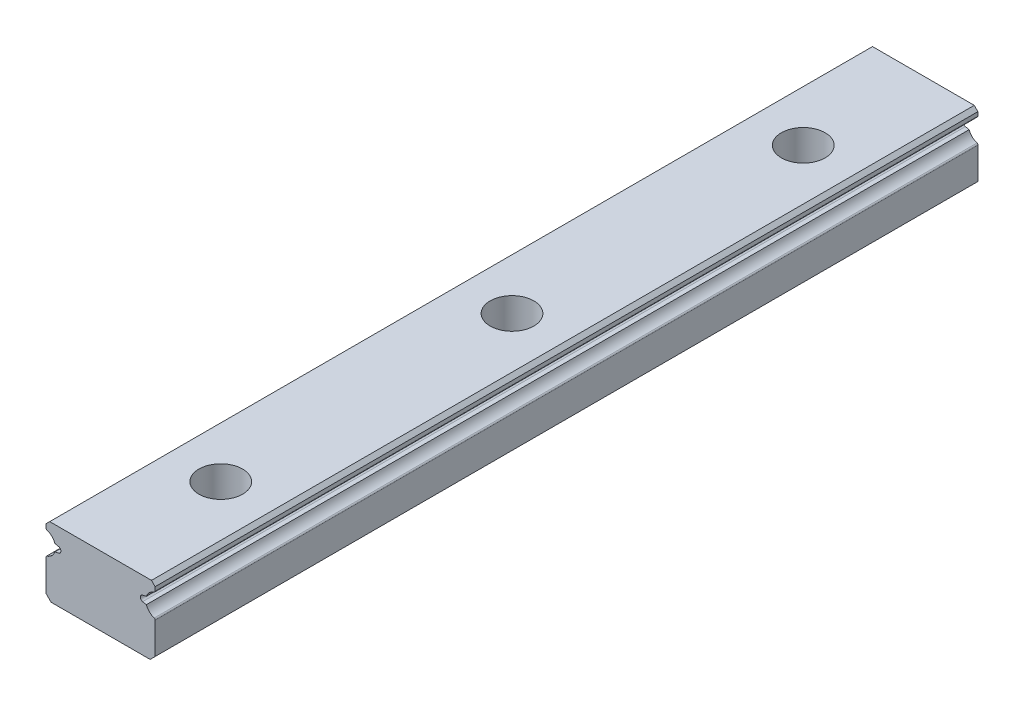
ISO-10303-21;
HEADER;
FILE_DESCRIPTION(('STEP AP214'),'2;1');
FILE_NAME('part.step','',(''),(''),'','','');
FILE_SCHEMA(('AUTOMOTIVE_DESIGN { 1 0 10303 214 1 1 1 1 }'));
ENDSEC;
DATA;
#1=APPLICATION_CONTEXT('core data for automotive mechanical design processes');
#2=APPLICATION_PROTOCOL_DEFINITION('international standard','automotive_design',2000,#1);
#3=PRODUCT_CONTEXT('',#1,'mechanical');
#4=PRODUCT('Part','Part','',(#3));
#5=PRODUCT_RELATED_PRODUCT_CATEGORY('part','',(#4));
#6=PRODUCT_DEFINITION_FORMATION('','',#4);
#7=PRODUCT_DEFINITION_CONTEXT('part definition',#1,'design');
#8=PRODUCT_DEFINITION('design','',#6,#7);
#9=PRODUCT_DEFINITION_SHAPE('','',#8);
#10=(LENGTH_UNIT() NAMED_UNIT(*) SI_UNIT(.MILLI.,.METRE.));
#11=(NAMED_UNIT(*) PLANE_ANGLE_UNIT() SI_UNIT($,.RADIAN.));
#12=(NAMED_UNIT(*) SI_UNIT($,.STERADIAN.) SOLID_ANGLE_UNIT());
#13=UNCERTAINTY_MEASURE_WITH_UNIT(LENGTH_MEASURE(1.E-05),#10,'distance_accuracy_value','');
#14=(GEOMETRIC_REPRESENTATION_CONTEXT(3) GLOBAL_UNCERTAINTY_ASSIGNED_CONTEXT((#13)) GLOBAL_UNIT_ASSIGNED_CONTEXT((#10,
#11,#12)) REPRESENTATION_CONTEXT('',''));
#15=CARTESIAN_POINT('',(0.,0.,0.));
#16=DIRECTION('',(0.,0.,1.));
#17=DIRECTION('',(1.,0.,0.));
#18=AXIS2_PLACEMENT_3D('',#15,#16,#17);
#19=CARTESIAN_POINT('',(-6.27999999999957,-8.749,-113.));
#20=DIRECTION('',(-0.209659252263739,-0.977774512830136,0.));
#21=DIRECTION('',(0.977774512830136,-0.209659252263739,0.));
#22=AXIS2_PLACEMENT_3D('',#19,#20,#21);
#23=PLANE('',#22);
#24=DIRECTION('',(0.977774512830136,-0.209659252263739,0.));
#25=VECTOR('',#24,1.);
#26=CARTESIAN_POINT('',(-6.27999999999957,-8.749,-113.));
#27=LINE('',#26,#25);
#28=CARTESIAN_POINT('',(-6.27999999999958,-8.749,-113.));
#29=VERTEX_POINT('',#28);
#30=CARTESIAN_POINT('',(-5.76751090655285,-8.85889044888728,-113.));
#31=VERTEX_POINT('',#30);
#32=EDGE_CURVE('E211',#29,#31,#27,.T.);
#33=ORIENTED_EDGE('',*,*,#32,.T.);
#34=DIRECTION('',(0.,0.,-1.));
#35=VECTOR('',#34,1.);
#36=CARTESIAN_POINT('',(-5.76751053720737,-8.85889052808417,-113.));
#37=LINE('',#36,#35);
#38=CARTESIAN_POINT('',(-5.76751090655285,-8.85889044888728,0.));
#39=VERTEX_POINT('',#38);
#40=EDGE_CURVE('E182',#31,#39,#37,.F.);
#41=ORIENTED_EDGE('',*,*,#40,.T.);
#42=DIRECTION('',(0.977774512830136,-0.209659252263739,0.));
#43=VECTOR('',#42,1.);
#44=CARTESIAN_POINT('',(-6.27999999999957,-8.749,0.));
#45=LINE('',#44,#43);
#46=CARTESIAN_POINT('',(-6.27999999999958,-8.749,0.));
#47=VERTEX_POINT('',#46);
#48=EDGE_CURVE('E219',#39,#47,#45,.F.);
#49=ORIENTED_EDGE('',*,*,#48,.T.);
#50=DIRECTION('',(0.,0.,-1.));
#51=VECTOR('',#50,1.);
#52=CARTESIAN_POINT('',(-6.27999999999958,-8.749,-113.));
#53=LINE('',#52,#51);
#54=EDGE_CURVE('E214',#47,#29,#53,.T.);
#55=ORIENTED_EDGE('',*,*,#54,.T.);
#56=EDGE_LOOP('',(#33,#41,#49,#55));
#57=FACE_BOUND('',#56,.T.);
#58=ADVANCED_FACE('F16',(#57),#23,.T.);
#59=CARTESIAN_POINT('',(5.7675105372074,-8.85889052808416,-113.));
#60=DIRECTION('',(0.20965925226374,-0.977774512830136,0.));
#61=DIRECTION('',(0.977774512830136,0.20965925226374,0.));
#62=AXIS2_PLACEMENT_3D('',#59,#60,#61);
#63=PLANE('',#62);
#64=DIRECTION('',(0.977774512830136,0.20965925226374,0.));
#65=VECTOR('',#64,1.);
#66=CARTESIAN_POINT('',(5.7675105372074,-8.85889052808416,-113.));
#67=LINE('',#66,#65);
#68=CARTESIAN_POINT('',(5.76751090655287,-8.85889044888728,-113.));
#69=VERTEX_POINT('',#68);
#70=CARTESIAN_POINT('',(6.27999999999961,-8.749,-113.));
#71=VERTEX_POINT('',#70);
#72=EDGE_CURVE('E184',#69,#71,#67,.T.);
#73=ORIENTED_EDGE('',*,*,#72,.T.);
#74=DIRECTION('',(0.,0.,-1.));
#75=VECTOR('',#74,1.);
#76=CARTESIAN_POINT('',(6.27999999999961,-8.749,-113.));
#77=LINE('',#76,#75);
#78=CARTESIAN_POINT('',(6.27999999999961,-8.749,0.));
#79=VERTEX_POINT('',#78);
#80=EDGE_CURVE('E222',#71,#79,#77,.F.);
#81=ORIENTED_EDGE('',*,*,#80,.T.);
#82=DIRECTION('',(0.977774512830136,0.20965925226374,0.));
#83=VECTOR('',#82,1.);
#84=CARTESIAN_POINT('',(5.7675105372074,-8.85889052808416,0.));
#85=LINE('',#84,#83);
#86=CARTESIAN_POINT('',(5.76751090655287,-8.85889044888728,0.));
#87=VERTEX_POINT('',#86);
#88=EDGE_CURVE('E209',#79,#87,#85,.F.);
#89=ORIENTED_EDGE('',*,*,#88,.T.);
#90=DIRECTION('',(0.,0.,-1.));
#91=VECTOR('',#90,1.);
#92=CARTESIAN_POINT('',(5.7675105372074,-8.85889052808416,-113.));
#93=LINE('',#92,#91);
#94=EDGE_CURVE('E204',#87,#69,#93,.T.);
#95=ORIENTED_EDGE('',*,*,#94,.T.);
#96=EDGE_LOOP('',(#73,#81,#89,#95));
#97=FACE_BOUND('',#96,.T.);
#98=ADVANCED_FACE('F792',(#97),#63,.T.);
#99=CARTESIAN_POINT('',(-5.85137497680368,-9.25000017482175,-113.));
#100=DIRECTION('',(0.,0.,-1.));
#101=DIRECTION('',(-1.,0.,0.));
#102=AXIS2_PLACEMENT_3D('',#99,#100,#101);
#103=CYLINDRICAL_SURFACE('',#102,0.4);
#104=ORIENTED_EDGE('',*,*,#40,.F.);
#105=CARTESIAN_POINT('',(-5.85137497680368,-9.25000017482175,-113.));
#106=DIRECTION('',(0.,0.,-1.));
#107=DIRECTION('',(-1.,0.,0.));
#108=AXIS2_PLACEMENT_3D('',#105,#106,#107);
#109=CIRCLE('',#108,0.4);
#110=CARTESIAN_POINT('',(-5.767,-9.641,-113.));
#111=VERTEX_POINT('',#110);
#112=EDGE_CURVE('E19',#111,#31,#109,.F.);
#113=ORIENTED_EDGE('',*,*,#112,.F.);
#114=DIRECTION('',(0.,0.,1.));
#115=VECTOR('',#114,1.);
#116=CARTESIAN_POINT('',(-5.767,-9.641,-113.));
#117=LINE('',#116,#115);
#118=CARTESIAN_POINT('',(-5.767,-9.641,0.));
#119=VERTEX_POINT('',#118);
#120=EDGE_CURVE('E179',#119,#111,#117,.F.);
#121=ORIENTED_EDGE('',*,*,#120,.F.);
#122=CARTESIAN_POINT('',(-5.85137497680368,-9.25000017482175,0.));
#123=DIRECTION('',(0.,0.,-1.));
#124=DIRECTION('',(-1.,0.,0.));
#125=AXIS2_PLACEMENT_3D('',#122,#123,#124);
#126=CIRCLE('',#125,0.4);
#127=EDGE_CURVE('E226',#39,#119,#126,.T.);
#128=ORIENTED_EDGE('',*,*,#127,.F.);
#129=EDGE_LOOP('',(#104,#113,#121,#128));
#130=FACE_BOUND('',#129,.T.);
#131=ADVANCED_FACE('F176',(#130),#103,.F.);
#132=CARTESIAN_POINT('',(7.89004225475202,-9.33975285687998,-113.));
#133=DIRECTION('',(0.,0.,-1.));
#134=DIRECTION('',(-1.,0.,0.));
#135=AXIS2_PLACEMENT_3D('',#132,#133,#134);
#136=CYLINDRICAL_SURFACE('',#135,1.715);
#137=ORIENTED_EDGE('',*,*,#80,.F.);
#138=CARTESIAN_POINT('',(7.89004225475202,-9.33975285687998,-113.));
#139=DIRECTION('',(0.,0.,-1.));
#140=DIRECTION('',(-1.,0.,0.));
#141=AXIS2_PLACEMENT_3D('',#138,#139,#140);
#142=CIRCLE('',#141,1.715);
#143=CARTESIAN_POINT('',(7.35000000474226,-7.71199999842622,-113.));
#144=VERTEX_POINT('',#143);
#145=EDGE_CURVE('E225',#144,#71,#142,.F.);
#146=ORIENTED_EDGE('',*,*,#145,.F.);
#147=DIRECTION('',(0.,0.,-1.));
#148=VECTOR('',#147,1.);
#149=CARTESIAN_POINT('',(7.35000000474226,-7.71199999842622,-113.));
#150=LINE('',#149,#148);
#151=CARTESIAN_POINT('',(7.35000000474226,-7.71199999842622,0.));
#152=VERTEX_POINT('',#151);
#153=EDGE_CURVE('E202',#152,#144,#150,.T.);
#154=ORIENTED_EDGE('',*,*,#153,.F.);
#155=CARTESIAN_POINT('',(7.89004225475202,-9.33975285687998,0.));
#156=DIRECTION('',(0.,0.,-1.));
#157=DIRECTION('',(-1.,0.,0.));
#158=AXIS2_PLACEMENT_3D('',#155,#156,#157);
#159=CIRCLE('',#158,1.715);
#160=EDGE_CURVE('E218',#79,#152,#159,.T.);
#161=ORIENTED_EDGE('',*,*,#160,.F.);
#162=EDGE_LOOP('',(#137,#146,#154,#161));
#163=FACE_BOUND('',#162,.T.);
#164=ADVANCED_FACE('F776',(#163),#136,.F.);
#165=CARTESIAN_POINT('',(-7.890042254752,-9.33975285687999,-113.));
#166=DIRECTION('',(0.,0.,-1.));
#167=DIRECTION('',(-1.,0.,0.));
#168=AXIS2_PLACEMENT_3D('',#165,#166,#167);
#169=CYLINDRICAL_SURFACE('',#168,1.715);
#170=DIRECTION('',(0.,0.,-1.));
#171=VECTOR('',#170,1.);
#172=CARTESIAN_POINT('',(-7.34999999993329,-7.7120000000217,-113.));
#173=LINE('',#172,#171);
#174=CARTESIAN_POINT('',(-7.34999999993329,-7.71200000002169,-113.));
#175=VERTEX_POINT('',#174);
#176=CARTESIAN_POINT('',(-7.34999999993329,-7.7120000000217,0.));
#177=VERTEX_POINT('',#176);
#178=EDGE_CURVE('E297',#175,#177,#173,.F.);
#179=ORIENTED_EDGE('',*,*,#178,.F.);
#180=CARTESIAN_POINT('',(-7.890042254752,-9.33975285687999,-113.));
#181=DIRECTION('',(0.,0.,-1.));
#182=DIRECTION('',(-1.,0.,0.));
#183=AXIS2_PLACEMENT_3D('',#180,#181,#182);
#184=CIRCLE('',#183,1.715);
#185=EDGE_CURVE('E217',#29,#175,#184,.F.);
#186=ORIENTED_EDGE('',*,*,#185,.F.);
#187=ORIENTED_EDGE('',*,*,#54,.F.);
#188=CARTESIAN_POINT('',(-7.890042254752,-9.33975285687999,0.));
#189=DIRECTION('',(0.,0.,-1.));
#190=DIRECTION('',(-1.,0.,0.));
#191=AXIS2_PLACEMENT_3D('',#188,#189,#190);
#192=CIRCLE('',#191,1.715);
#193=EDGE_CURVE('E208',#177,#47,#192,.T.);
#194=ORIENTED_EDGE('',*,*,#193,.F.);
#195=EDGE_LOOP('',(#179,#186,#187,#194));
#196=FACE_BOUND('',#195,.T.);
#197=ADVANCED_FACE('F322',(#196),#169,.F.);
#198=CARTESIAN_POINT('',(5.85137497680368,-9.25000017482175,-113.));
#199=DIRECTION('',(0.,0.,-1.));
#200=DIRECTION('',(-1.,0.,0.));
#201=AXIS2_PLACEMENT_3D('',#198,#199,#200);
#202=CYLINDRICAL_SURFACE('',#201,0.4);
#203=DIRECTION('',(0.,0.,1.));
#204=VECTOR('',#203,1.);
#205=CARTESIAN_POINT('',(5.767,-9.641,-113.));
#206=LINE('',#205,#204);
#207=CARTESIAN_POINT('',(5.767,-9.641,-113.));
#208=VERTEX_POINT('',#207);
#209=CARTESIAN_POINT('',(5.767,-9.641,0.));
#210=VERTEX_POINT('',#209);
#211=EDGE_CURVE('E293',#208,#210,#206,.T.);
#212=ORIENTED_EDGE('',*,*,#211,.F.);
#213=CARTESIAN_POINT('',(5.85137497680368,-9.25000017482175,-113.));
#214=DIRECTION('',(0.,0.,-1.));
#215=DIRECTION('',(-1.,0.,0.));
#216=AXIS2_PLACEMENT_3D('',#213,#214,#215);
#217=CIRCLE('',#216,0.4);
#218=EDGE_CURVE('E207',#69,#208,#217,.F.);
#219=ORIENTED_EDGE('',*,*,#218,.F.);
#220=ORIENTED_EDGE('',*,*,#94,.F.);
#221=CARTESIAN_POINT('',(5.85137497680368,-9.25000017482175,0.));
#222=DIRECTION('',(0.,0.,-1.));
#223=DIRECTION('',(-1.,0.,0.));
#224=AXIS2_PLACEMENT_3D('',#221,#222,#223);
#225=CIRCLE('',#224,0.4);
#226=EDGE_CURVE('E198',#210,#87,#225,.T.);
#227=ORIENTED_EDGE('',*,*,#226,.F.);
#228=EDGE_LOOP('',(#212,#219,#220,#227));
#229=FACE_BOUND('',#228,.T.);
#230=ADVANCED_FACE('F760',(#229),#202,.F.);
#231=CARTESIAN_POINT('',(-5.767,-9.641,-113.));
#232=DIRECTION('',(-0.207835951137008,0.978163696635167,0.));
#233=DIRECTION('',(-0.978163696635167,-0.207835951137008,0.));
#234=AXIS2_PLACEMENT_3D('',#231,#232,#233);
#235=PLANE('',#234);
#236=DIRECTION('',(-0.978163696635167,-0.207835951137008,0.));
#237=VECTOR('',#236,1.);
#238=CARTESIAN_POINT('',(-5.767,-9.641,-113.));
#239=LINE('',#238,#237);
#240=CARTESIAN_POINT('',(-6.28,-9.75,-113.));
#241=VERTEX_POINT('',#240);
#242=EDGE_CURVE('E186',#111,#241,#239,.T.);
#243=ORIENTED_EDGE('',*,*,#242,.T.);
#244=DIRECTION('',(0.,0.,-1.));
#245=VECTOR('',#244,1.);
#246=CARTESIAN_POINT('',(-6.28,-9.75,-113.));
#247=LINE('',#246,#245);
#248=CARTESIAN_POINT('',(-6.28,-9.75,0.));
#249=VERTEX_POINT('',#248);
#250=EDGE_CURVE('E291',#241,#249,#247,.F.);
#251=ORIENTED_EDGE('',*,*,#250,.T.);
#252=DIRECTION('',(-0.978163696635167,-0.207835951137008,0.));
#253=VECTOR('',#252,1.);
#254=CARTESIAN_POINT('',(-5.767,-9.641,0.));
#255=LINE('',#254,#253);
#256=EDGE_CURVE('E196',#249,#119,#255,.F.);
#257=ORIENTED_EDGE('',*,*,#256,.T.);
#258=ORIENTED_EDGE('',*,*,#120,.T.);
#259=EDGE_LOOP('',(#243,#251,#257,#258));
#260=FACE_BOUND('',#259,.T.);
#261=ADVANCED_FACE('F195',(#260),#235,.T.);
#262=CARTESIAN_POINT('',(7.287,-7.52218166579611,-113.));
#263=DIRECTION('',(0.,0.,-1.));
#264=DIRECTION('',(-1.,0.,0.));
#265=AXIS2_PLACEMENT_3D('',#262,#263,#264);
#266=CYLINDRICAL_SURFACE('',#265,0.2);
#267=CARTESIAN_POINT('',(7.287,-7.52218166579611,-113.));
#268=DIRECTION('',(0.,0.,-1.));
#269=DIRECTION('',(-1.,0.,0.));
#270=AXIS2_PLACEMENT_3D('',#267,#268,#269);
#271=CIRCLE('',#270,0.2);
#272=CARTESIAN_POINT('',(7.487,-7.52218165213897,-113.));
#273=VERTEX_POINT('',#272);
#274=EDGE_CURVE('E301',#144,#273,#271,.F.);
#275=ORIENTED_EDGE('',*,*,#274,.T.);
#276=DIRECTION('',(0.,0.,-1.));
#277=VECTOR('',#276,1.);
#278=CARTESIAN_POINT('',(7.487,-7.52218163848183,-113.));
#279=LINE('',#278,#277);
#280=CARTESIAN_POINT('',(7.487,-7.52218165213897,0.));
#281=VERTEX_POINT('',#280);
#282=EDGE_CURVE('E359',#281,#273,#279,.T.);
#283=ORIENTED_EDGE('',*,*,#282,.F.);
#284=CARTESIAN_POINT('',(7.287,-7.52218166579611,0.));
#285=DIRECTION('',(0.,0.,-1.));
#286=DIRECTION('',(-1.,0.,0.));
#287=AXIS2_PLACEMENT_3D('',#284,#285,#286);
#288=CIRCLE('',#287,0.2);
#289=EDGE_CURVE('E193',#281,#152,#288,.T.);
#290=ORIENTED_EDGE('',*,*,#289,.T.);
#291=ORIENTED_EDGE('',*,*,#153,.T.);
#292=EDGE_LOOP('',(#275,#283,#290,#291));
#293=FACE_BOUND('',#292,.T.);
#294=ADVANCED_FACE('F745',(#293),#266,.T.);
#295=CARTESIAN_POINT('',(-7.288,-7.52185268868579,-113.));
#296=DIRECTION('',(0.,0.,-1.));
#297=DIRECTION('',(-1.,0.,0.));
#298=AXIS2_PLACEMENT_3D('',#295,#296,#297);
#299=CYLINDRICAL_SURFACE('',#298,0.200000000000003);
#300=CARTESIAN_POINT('',(-7.288,-7.52185268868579,-113.));
#301=DIRECTION('',(0.,0.,-1.));
#302=DIRECTION('',(-1.,0.,0.));
#303=AXIS2_PLACEMENT_3D('',#300,#301,#302);
#304=CIRCLE('',#303,0.200000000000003);
#305=CARTESIAN_POINT('',(-7.488,-7.52185267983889,-113.));
#306=VERTEX_POINT('',#305);
#307=EDGE_CURVE('E294',#306,#175,#304,.F.);
#308=ORIENTED_EDGE('',*,*,#307,.T.);
#309=ORIENTED_EDGE('',*,*,#178,.T.);
#310=CARTESIAN_POINT('',(-7.288,-7.52185268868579,0.));
#311=DIRECTION('',(0.,0.,-1.));
#312=DIRECTION('',(-1.,0.,0.));
#313=AXIS2_PLACEMENT_3D('',#310,#311,#312);
#314=CIRCLE('',#313,0.200000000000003);
#315=CARTESIAN_POINT('',(-7.488,-7.52185267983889,0.));
#316=VERTEX_POINT('',#315);
#317=EDGE_CURVE('E298',#177,#316,#314,.T.);
#318=ORIENTED_EDGE('',*,*,#317,.T.);
#319=DIRECTION('',(0.,0.,1.));
#320=VECTOR('',#319,1.);
#321=CARTESIAN_POINT('',(-7.488,-7.52185267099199,-113.));
#322=LINE('',#321,#320);
#323=EDGE_CURVE('E327',#306,#316,#322,.T.);
#324=ORIENTED_EDGE('',*,*,#323,.F.);
#325=EDGE_LOOP('',(#308,#309,#318,#324));
#326=FACE_BOUND('',#325,.T.);
#327=ADVANCED_FACE('F325',(#326),#299,.T.);
#328=CARTESIAN_POINT('',(6.28,-9.75,-113.));
#329=DIRECTION('',(0.207835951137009,0.978163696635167,0.));
#330=DIRECTION('',(-0.978163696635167,0.207835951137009,0.));
#331=AXIS2_PLACEMENT_3D('',#328,#329,#330);
#332=PLANE('',#331);
#333=DIRECTION('',(-0.978163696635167,0.207835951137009,0.));
#334=VECTOR('',#333,1.);
#335=CARTESIAN_POINT('',(6.28,-9.75,-113.));
#336=LINE('',#335,#334);
#337=CARTESIAN_POINT('',(6.28,-9.75,-113.));
#338=VERTEX_POINT('',#337);
#339=EDGE_CURVE('E383',#338,#208,#336,.T.);
#340=ORIENTED_EDGE('',*,*,#339,.T.);
#341=ORIENTED_EDGE('',*,*,#211,.T.);
#342=DIRECTION('',(-0.978163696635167,0.207835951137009,0.));
#343=VECTOR('',#342,1.);
#344=CARTESIAN_POINT('',(6.28,-9.75,0.));
#345=LINE('',#344,#343);
#346=CARTESIAN_POINT('',(6.28,-9.75,0.));
#347=VERTEX_POINT('',#346);
#348=EDGE_CURVE('E324',#210,#347,#345,.F.);
#349=ORIENTED_EDGE('',*,*,#348,.T.);
#350=DIRECTION('',(0.,0.,-1.));
#351=VECTOR('',#350,1.);
#352=CARTESIAN_POINT('',(6.28,-9.75,-113.));
#353=LINE('',#352,#351);
#354=EDGE_CURVE('E287',#347,#338,#353,.T.);
#355=ORIENTED_EDGE('',*,*,#354,.T.);
#356=EDGE_LOOP('',(#340,#341,#349,#355));
#357=FACE_BOUND('',#356,.T.);
#358=ADVANCED_FACE('F490',(#357),#332,.T.);
#359=CARTESIAN_POINT('',(-7.89007044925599,-9.159323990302,-113.));
#360=DIRECTION('',(0.,0.,-1.));
#361=DIRECTION('',(-1.,0.,0.));
#362=AXIS2_PLACEMENT_3D('',#359,#360,#361);
#363=CYLINDRICAL_SURFACE('',#362,1.715);
#364=ORIENTED_EDGE('',*,*,#250,.F.);
#365=CARTESIAN_POINT('',(-7.89007044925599,-9.159323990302,-113.));
#366=DIRECTION('',(0.,0.,-1.));
#367=DIRECTION('',(-1.,0.,0.));
#368=AXIS2_PLACEMENT_3D('',#365,#366,#367);
#369=CIRCLE('',#368,1.715);
#370=CARTESIAN_POINT('',(-7.36199999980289,-10.7909999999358,-113.));
#371=VERTEX_POINT('',#370);
#372=EDGE_CURVE('E189',#371,#241,#369,.F.);
#373=ORIENTED_EDGE('',*,*,#372,.F.);
#374=DIRECTION('',(0.,0.,-1.));
#375=VECTOR('',#374,1.);
#376=CARTESIAN_POINT('',(-7.36199999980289,-10.7909999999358,-113.));
#377=LINE('',#376,#375);
#378=CARTESIAN_POINT('',(-7.36199999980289,-10.7909999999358,0.));
#379=VERTEX_POINT('',#378);
#380=EDGE_CURVE('E278',#379,#371,#377,.T.);
#381=ORIENTED_EDGE('',*,*,#380,.F.);
#382=CARTESIAN_POINT('',(-7.89007044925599,-9.159323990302,0.));
#383=DIRECTION('',(0.,0.,-1.));
#384=DIRECTION('',(-1.,0.,0.));
#385=AXIS2_PLACEMENT_3D('',#382,#383,#384);
#386=CIRCLE('',#385,1.715);
#387=EDGE_CURVE('E288',#249,#379,#386,.T.);
#388=ORIENTED_EDGE('',*,*,#387,.F.);
#389=EDGE_LOOP('',(#364,#373,#381,#388));
#390=FACE_BOUND('',#389,.T.);
#391=ADVANCED_FACE('F487',(#390),#363,.F.);
#392=CARTESIAN_POINT('',(7.487,-7.52218163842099,-113.));
#393=DIRECTION('',(1.,0.,0.));
#394=DIRECTION('',(0.,0.,-1.));
#395=AXIS2_PLACEMENT_3D('',#392,#393,#394);
#396=PLANE('',#395);
#397=DIRECTION('',(0.,1.,0.));
#398=VECTOR('',#397,1.);
#399=CARTESIAN_POINT('',(7.487,-7.52218163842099,-113.));
#400=LINE('',#399,#398);
#401=CARTESIAN_POINT('',(7.487,-7.,-113.));
#402=VERTEX_POINT('',#401);
#403=EDGE_CURVE('E339',#273,#402,#400,.T.);
#404=ORIENTED_EDGE('',*,*,#403,.T.);
#405=DIRECTION('',(0.,0.,1.));
#406=VECTOR('',#405,1.);
#407=CARTESIAN_POINT('',(7.487,-7.,-113.));
#408=LINE('',#407,#406);
#409=CARTESIAN_POINT('',(7.487,-7.,0.));
#410=VERTEX_POINT('',#409);
#411=EDGE_CURVE('E366',#410,#402,#408,.F.);
#412=ORIENTED_EDGE('',*,*,#411,.F.);
#413=DIRECTION('',(0.,1.,0.));
#414=VECTOR('',#413,1.);
#415=CARTESIAN_POINT('',(7.487,-7.52218163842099,0.));
#416=LINE('',#415,#414);
#417=EDGE_CURVE('E290',#410,#281,#416,.F.);
#418=ORIENTED_EDGE('',*,*,#417,.T.);
#419=ORIENTED_EDGE('',*,*,#282,.T.);
#420=EDGE_LOOP('',(#404,#412,#418,#419));
#421=FACE_BOUND('',#420,.T.);
#422=ADVANCED_FACE('F489',(#421),#396,.T.);
#423=CARTESIAN_POINT('',(-7.488,-7.,-113.));
#424=DIRECTION('',(-1.,0.,0.));
#425=DIRECTION('',(0.,0.,1.));
#426=AXIS2_PLACEMENT_3D('',#423,#424,#425);
#427=PLANE('',#426);
#428=DIRECTION('',(0.,1.,0.));
#429=VECTOR('',#428,1.);
#430=CARTESIAN_POINT('',(-7.488,-7.,-113.));
#431=LINE('',#430,#429);
#432=CARTESIAN_POINT('',(-7.488,-7.,-113.));
#433=VERTEX_POINT('',#432);
#434=EDGE_CURVE('E331',#433,#306,#431,.F.);
#435=ORIENTED_EDGE('',*,*,#434,.T.);
#436=ORIENTED_EDGE('',*,*,#323,.T.);
#437=DIRECTION('',(0.,1.,0.));
#438=VECTOR('',#437,1.);
#439=CARTESIAN_POINT('',(-7.488,-7.,0.));
#440=LINE('',#439,#438);
#441=CARTESIAN_POINT('',(-7.488,-7.,0.));
#442=VERTEX_POINT('',#441);
#443=EDGE_CURVE('E337',#316,#442,#440,.T.);
#444=ORIENTED_EDGE('',*,*,#443,.T.);
#445=DIRECTION('',(0.,0.,1.));
#446=VECTOR('',#445,1.);
#447=CARTESIAN_POINT('',(-7.488,-7.,-113.));
#448=LINE('',#447,#446);
#449=EDGE_CURVE('E274',#433,#442,#448,.T.);
#450=ORIENTED_EDGE('',*,*,#449,.F.);
#451=EDGE_LOOP('',(#435,#436,#444,#450));
#452=FACE_BOUND('',#451,.T.);
#453=ADVANCED_FACE('F334',(#452),#427,.T.);
#454=CARTESIAN_POINT('',(7.890070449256,-9.159323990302,-113.));
#455=DIRECTION('',(0.,0.,-1.));
#456=DIRECTION('',(-1.,0.,0.));
#457=AXIS2_PLACEMENT_3D('',#454,#455,#456);
#458=CYLINDRICAL_SURFACE('',#457,1.715);
#459=DIRECTION('',(0.,0.,-1.));
#460=VECTOR('',#459,1.);
#461=CARTESIAN_POINT('',(7.36199999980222,-10.7909999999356,-113.));
#462=LINE('',#461,#460);
#463=CARTESIAN_POINT('',(7.36199999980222,-10.7909999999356,-113.));
#464=VERTEX_POINT('',#463);
#465=CARTESIAN_POINT('',(7.36199999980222,-10.7909999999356,0.));
#466=VERTEX_POINT('',#465);
#467=EDGE_CURVE('E268',#464,#466,#462,.F.);
#468=ORIENTED_EDGE('',*,*,#467,.F.);
#469=CARTESIAN_POINT('',(7.890070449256,-9.159323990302,-113.));
#470=DIRECTION('',(0.,0.,-1.));
#471=DIRECTION('',(-1.,0.,0.));
#472=AXIS2_PLACEMENT_3D('',#469,#470,#471);
#473=CIRCLE('',#472,1.715);
#474=EDGE_CURVE('E285',#338,#464,#473,.F.);
#475=ORIENTED_EDGE('',*,*,#474,.F.);
#476=ORIENTED_EDGE('',*,*,#354,.F.);
#477=CARTESIAN_POINT('',(7.890070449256,-9.159323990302,0.));
#478=DIRECTION('',(0.,0.,-1.));
#479=DIRECTION('',(-1.,0.,0.));
#480=AXIS2_PLACEMENT_3D('',#477,#478,#479);
#481=CIRCLE('',#480,1.715);
#482=EDGE_CURVE('E282',#466,#347,#481,.T.);
#483=ORIENTED_EDGE('',*,*,#482,.F.);
#484=EDGE_LOOP('',(#468,#475,#476,#483));
#485=FACE_BOUND('',#484,.T.);
#486=ADVANCED_FACE('F577',(#485),#458,.F.);
#487=CARTESIAN_POINT('',(-7.3,-10.9811473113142,-113.));
#488=DIRECTION('',(0.,0.,-1.));
#489=DIRECTION('',(-1.,0.,0.));
#490=AXIS2_PLACEMENT_3D('',#487,#488,#489);
#491=CYLINDRICAL_SURFACE('',#490,0.200000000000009);
#492=CARTESIAN_POINT('',(-7.3,-10.9811473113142,-113.));
#493=DIRECTION('',(0.,0.,-1.));
#494=DIRECTION('',(-1.,0.,0.));
#495=AXIS2_PLACEMENT_3D('',#492,#493,#494);
#496=CIRCLE('',#495,0.200000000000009);
#497=CARTESIAN_POINT('',(-7.5,-10.9811473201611,-113.));
#498=VERTEX_POINT('',#497);
#499=EDGE_CURVE('E275',#371,#498,#496,.F.);
#500=ORIENTED_EDGE('',*,*,#499,.T.);
#501=DIRECTION('',(0.,0.,1.));
#502=VECTOR('',#501,1.);
#503=CARTESIAN_POINT('',(-7.5,-10.981147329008,-113.));
#504=LINE('',#503,#502);
#505=CARTESIAN_POINT('',(-7.5,-10.9811473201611,0.));
#506=VERTEX_POINT('',#505);
#507=EDGE_CURVE('E264',#506,#498,#504,.F.);
#508=ORIENTED_EDGE('',*,*,#507,.F.);
#509=CARTESIAN_POINT('',(-7.3,-10.9811473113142,0.));
#510=DIRECTION('',(0.,0.,-1.));
#511=DIRECTION('',(-1.,0.,0.));
#512=AXIS2_PLACEMENT_3D('',#509,#510,#511);
#513=CIRCLE('',#512,0.200000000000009);
#514=EDGE_CURVE('E279',#506,#379,#513,.T.);
#515=ORIENTED_EDGE('',*,*,#514,.T.);
#516=ORIENTED_EDGE('',*,*,#380,.T.);
#517=EDGE_LOOP('',(#500,#508,#515,#516));
#518=FACE_BOUND('',#517,.T.);
#519=ADVANCED_FACE('F483',(#518),#491,.T.);
#520=CARTESIAN_POINT('',(0.,-16.,-56.5));
#521=DIRECTION('',(0.,1.,0.));
#522=DIRECTION('',(0.,0.,1.));
#523=AXIS2_PLACEMENT_3D('',#520,#521,#522);
#524=CYLINDRICAL_SURFACE('',#523,3.);
#525=CARTESIAN_POINT('',(0.,-6.5,-56.5));
#526=DIRECTION('',(0.,1.,0.));
#527=DIRECTION('',(0.,0.,1.));
#528=AXIS2_PLACEMENT_3D('',#525,#526,#527);
#529=CIRCLE('',#528,3.);
#530=CARTESIAN_POINT('',(0.,-6.5,-53.5));
#531=VERTEX_POINT('',#530);
#532=EDGE_CURVE('E260',#531,#531,#529,.F.);
#533=ORIENTED_EDGE('',*,*,#532,.F.);
#534=EDGE_LOOP('',(#533));
#535=FACE_BOUND('',#534,.T.);
#536=CARTESIAN_POINT('',(0.,-11.,-56.5));
#537=DIRECTION('',(0.,1.,0.));
#538=DIRECTION('',(0.,0.,1.));
#539=AXIS2_PLACEMENT_3D('',#536,#537,#538);
#540=CIRCLE('',#539,3.);
#541=CARTESIAN_POINT('',(0.,-11.,-53.5));
#542=VERTEX_POINT('',#541);
#543=EDGE_CURVE('E265',#542,#542,#540,.T.);
#544=ORIENTED_EDGE('',*,*,#543,.F.);
#545=EDGE_LOOP('',(#544));
#546=FACE_BOUND('',#545,.T.);
#547=ADVANCED_FACE('F570',(#535,#546),#524,.F.);
#548=CARTESIAN_POINT('',(7.487,-7.,-113.));
#549=DIRECTION('',(0.707106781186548,0.707106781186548,0.));
#550=DIRECTION('',(-0.707106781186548,0.707106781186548,0.));
#551=AXIS2_PLACEMENT_3D('',#548,#549,#550);
#552=PLANE('',#551);
#553=DIRECTION('',(-0.707106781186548,0.707106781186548,0.));
#554=VECTOR('',#553,1.);
#555=CARTESIAN_POINT('',(7.487,-7.,-113.));
#556=LINE('',#555,#554);
#557=CARTESIAN_POINT('',(6.987,-6.5,-113.));
#558=VERTEX_POINT('',#557);
#559=EDGE_CURVE('E356',#402,#558,#556,.T.);
#560=ORIENTED_EDGE('',*,*,#559,.T.);
#561=DIRECTION('',(0.,0.,1.));
#562=VECTOR('',#561,1.);
#563=CARTESIAN_POINT('',(6.987,-6.5,-113.));
#564=LINE('',#563,#562);
#565=CARTESIAN_POINT('',(6.987,-6.5,0.));
#566=VERTEX_POINT('',#565);
#567=EDGE_CURVE('E263',#566,#558,#564,.F.);
#568=ORIENTED_EDGE('',*,*,#567,.F.);
#569=DIRECTION('',(-0.707106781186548,0.707106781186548,0.));
#570=VECTOR('',#569,1.);
#571=CARTESIAN_POINT('',(7.487,-7.,0.));
#572=LINE('',#571,#570);
#573=EDGE_CURVE('E277',#566,#410,#572,.F.);
#574=ORIENTED_EDGE('',*,*,#573,.T.);
#575=ORIENTED_EDGE('',*,*,#411,.T.);
#576=EDGE_LOOP('',(#560,#568,#574,#575));
#577=FACE_BOUND('',#576,.T.);
#578=ADVANCED_FACE('F566',(#577),#552,.T.);
#579=CARTESIAN_POINT('',(-6.988,-6.5,-113.));
#580=DIRECTION('',(-0.707106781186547,0.707106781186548,0.));
#581=DIRECTION('',(-0.707106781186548,-0.707106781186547,0.));
#582=AXIS2_PLACEMENT_3D('',#579,#580,#581);
#583=PLANE('',#582);
#584=DIRECTION('',(-0.707106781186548,-0.707106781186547,0.));
#585=VECTOR('',#584,1.);
#586=CARTESIAN_POINT('',(-6.988,-6.5,-113.));
#587=LINE('',#586,#585);
#588=CARTESIAN_POINT('',(-6.988,-6.5,-113.));
#589=VERTEX_POINT('',#588);
#590=EDGE_CURVE('E346',#589,#433,#587,.T.);
#591=ORIENTED_EDGE('',*,*,#590,.T.);
#592=ORIENTED_EDGE('',*,*,#449,.T.);
#593=DIRECTION('',(-0.707106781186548,-0.707106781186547,0.));
#594=VECTOR('',#593,1.);
#595=CARTESIAN_POINT('',(-6.988,-6.5,0.));
#596=LINE('',#595,#594);
#597=CARTESIAN_POINT('',(-6.988,-6.5,0.));
#598=VERTEX_POINT('',#597);
#599=EDGE_CURVE('E350',#442,#598,#596,.F.);
#600=ORIENTED_EDGE('',*,*,#599,.T.);
#601=DIRECTION('',(0.,0.,1.));
#602=VECTOR('',#601,1.);
#603=CARTESIAN_POINT('',(-6.988,-6.5,-113.));
#604=LINE('',#603,#602);
#605=EDGE_CURVE('E259',#589,#598,#604,.T.);
#606=ORIENTED_EDGE('',*,*,#605,.F.);
#607=EDGE_LOOP('',(#591,#592,#600,#606));
#608=FACE_BOUND('',#607,.T.);
#609=ADVANCED_FACE('F562',(#608),#583,.T.);
#610=CARTESIAN_POINT('',(7.3,-10.9811473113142,-113.));
#611=DIRECTION('',(0.,0.,-1.));
#612=DIRECTION('',(-1.,0.,0.));
#613=AXIS2_PLACEMENT_3D('',#610,#611,#612);
#614=CYLINDRICAL_SURFACE('',#613,0.2);
#615=CARTESIAN_POINT('',(7.3,-10.9811473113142,-113.));
#616=DIRECTION('',(0.,0.,-1.));
#617=DIRECTION('',(-1.,0.,0.));
#618=AXIS2_PLACEMENT_3D('',#615,#616,#617);
#619=CIRCLE('',#618,0.2);
#620=CARTESIAN_POINT('',(7.5,-10.9811473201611,-113.));
#621=VERTEX_POINT('',#620);
#622=EDGE_CURVE('E269',#621,#464,#619,.F.);
#623=ORIENTED_EDGE('',*,*,#622,.T.);
#624=ORIENTED_EDGE('',*,*,#467,.T.);
#625=CARTESIAN_POINT('',(7.3,-10.9811473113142,0.));
#626=DIRECTION('',(0.,0.,-1.));
#627=DIRECTION('',(-1.,0.,0.));
#628=AXIS2_PLACEMENT_3D('',#625,#626,#627);
#629=CIRCLE('',#628,0.2);
#630=CARTESIAN_POINT('',(7.5,-10.9811473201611,0.));
#631=VERTEX_POINT('',#630);
#632=EDGE_CURVE('E272',#466,#631,#629,.T.);
#633=ORIENTED_EDGE('',*,*,#632,.T.);
#634=DIRECTION('',(0.,0.,-1.));
#635=VECTOR('',#634,1.);
#636=CARTESIAN_POINT('',(7.5,-10.981147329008,-113.));
#637=LINE('',#636,#635);
#638=EDGE_CURVE('E252',#621,#631,#637,.F.);
#639=ORIENTED_EDGE('',*,*,#638,.F.);
#640=EDGE_LOOP('',(#623,#624,#633,#639));
#641=FACE_BOUND('',#640,.T.);
#642=ADVANCED_FACE('F558',(#641),#614,.T.);
#643=CARTESIAN_POINT('',(0.,-16.,-16.5));
#644=DIRECTION('',(0.,1.,0.));
#645=DIRECTION('',(0.,0.,1.));
#646=AXIS2_PLACEMENT_3D('',#643,#644,#645);
#647=CYLINDRICAL_SURFACE('',#646,3.);
#648=CARTESIAN_POINT('',(0.,-6.5,-16.5));
#649=DIRECTION('',(0.,1.,0.));
#650=DIRECTION('',(0.,0.,1.));
#651=AXIS2_PLACEMENT_3D('',#648,#649,#650);
#652=CIRCLE('',#651,3.);
#653=CARTESIAN_POINT('',(0.,-6.5,-13.5));
#654=VERTEX_POINT('',#653);
#655=EDGE_CURVE('E256',#654,#654,#652,.F.);
#656=ORIENTED_EDGE('',*,*,#655,.F.);
#657=EDGE_LOOP('',(#656));
#658=FACE_BOUND('',#657,.T.);
#659=CARTESIAN_POINT('',(0.,-11.,-16.5));
#660=DIRECTION('',(0.,1.,0.));
#661=DIRECTION('',(0.,0.,1.));
#662=AXIS2_PLACEMENT_3D('',#659,#660,#661);
#663=CIRCLE('',#662,3.);
#664=CARTESIAN_POINT('',(0.,-11.,-13.5));
#665=VERTEX_POINT('',#664);
#666=EDGE_CURVE('E249',#665,#665,#663,.T.);
#667=ORIENTED_EDGE('',*,*,#666,.F.);
#668=EDGE_LOOP('',(#667));
#669=FACE_BOUND('',#668,.T.);
#670=ADVANCED_FACE('F554',(#658,#669),#647,.F.);
#671=CARTESIAN_POINT('',(0.,-16.,-96.5));
#672=DIRECTION('',(0.,1.,0.));
#673=DIRECTION('',(0.,0.,1.));
#674=AXIS2_PLACEMENT_3D('',#671,#672,#673);
#675=CYLINDRICAL_SURFACE('',#674,3.);
#676=CARTESIAN_POINT('',(0.,-6.5,-96.5));
#677=DIRECTION('',(0.,1.,0.));
#678=DIRECTION('',(0.,0.,1.));
#679=AXIS2_PLACEMENT_3D('',#676,#677,#678);
#680=CIRCLE('',#679,3.);
#681=CARTESIAN_POINT('',(0.,-6.5,-93.5));
#682=VERTEX_POINT('',#681);
#683=EDGE_CURVE('E253',#682,#682,#680,.F.);
#684=ORIENTED_EDGE('',*,*,#683,.F.);
#685=EDGE_LOOP('',(#684));
#686=FACE_BOUND('',#685,.T.);
#687=CARTESIAN_POINT('',(0.,-11.,-96.5));
#688=DIRECTION('',(0.,1.,0.));
#689=DIRECTION('',(0.,0.,1.));
#690=AXIS2_PLACEMENT_3D('',#687,#688,#689);
#691=CIRCLE('',#690,3.);
#692=CARTESIAN_POINT('',(0.,-11.,-93.5));
#693=VERTEX_POINT('',#692);
#694=EDGE_CURVE('E246',#693,#693,#691,.T.);
#695=ORIENTED_EDGE('',*,*,#694,.F.);
#696=EDGE_LOOP('',(#695));
#697=FACE_BOUND('',#696,.T.);
#698=ADVANCED_FACE('F550',(#686,#697),#675,.F.);
#699=CARTESIAN_POINT('',(0.,-11.,-59.5));
#700=DIRECTION('',(0.,1.,0.));
#701=DIRECTION('',(0.,0.,1.));
#702=AXIS2_PLACEMENT_3D('',#699,#700,#701);
#703=PLANE('',#702);
#704=ORIENTED_EDGE('',*,*,#543,.T.);
#705=EDGE_LOOP('',(#704));
#706=FACE_BOUND('',#705,.T.);
#707=CARTESIAN_POINT('',(0.,-11.,-56.5));
#708=DIRECTION('',(0.,1.,0.));
#709=DIRECTION('',(0.,0.,1.));
#710=AXIS2_PLACEMENT_3D('',#707,#708,#709);
#711=CIRCLE('',#710,1.75);
#712=CARTESIAN_POINT('',(0.,-11.,-54.75));
#713=VERTEX_POINT('',#712);
#714=EDGE_CURVE('E242',#713,#713,#711,.F.);
#715=ORIENTED_EDGE('',*,*,#714,.T.);
#716=EDGE_LOOP('',(#715));
#717=FACE_BOUND('',#716,.T.);
#718=ADVANCED_FACE('F547',(#706,#717),#703,.T.);
#719=CARTESIAN_POINT('',(-7.5,-10.981147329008,-113.));
#720=DIRECTION('',(-1.,0.,0.));
#721=DIRECTION('',(0.,0.,1.));
#722=AXIS2_PLACEMENT_3D('',#719,#720,#721);
#723=PLANE('',#722);
#724=DIRECTION('',(0.,1.,0.));
#725=VECTOR('',#724,1.);
#726=CARTESIAN_POINT('',(-7.5,-10.9811473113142,-113.));
#727=LINE('',#726,#725);
#728=CARTESIAN_POINT('',(-7.5,-15.3,-113.));
#729=VERTEX_POINT('',#728);
#730=EDGE_CURVE('E423',#498,#729,#727,.F.);
#731=ORIENTED_EDGE('',*,*,#730,.T.);
#732=DIRECTION('',(0.,0.,1.));
#733=VECTOR('',#732,1.);
#734=CARTESIAN_POINT('',(-7.5,-15.3,-113.));
#735=LINE('',#734,#733);
#736=CARTESIAN_POINT('',(-7.5,-15.3,0.));
#737=VERTEX_POINT('',#736);
#738=EDGE_CURVE('E416',#737,#729,#735,.F.);
#739=ORIENTED_EDGE('',*,*,#738,.F.);
#740=DIRECTION('',(0.,1.,0.));
#741=VECTOR('',#740,1.);
#742=CARTESIAN_POINT('',(-7.5,-10.9811473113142,0.));
#743=LINE('',#742,#741);
#744=EDGE_CURVE('E245',#506,#737,#743,.F.);
#745=ORIENTED_EDGE('',*,*,#744,.F.);
#746=ORIENTED_EDGE('',*,*,#507,.T.);
#747=EDGE_LOOP('',(#731,#739,#745,#746));
#748=FACE_BOUND('',#747,.T.);
#749=ADVANCED_FACE('F480',(#748),#723,.T.);
#750=CARTESIAN_POINT('',(6.987,-6.5,-113.));
#751=DIRECTION('',(0.,1.,0.));
#752=DIRECTION('',(0.,0.,1.));
#753=AXIS2_PLACEMENT_3D('',#750,#751,#752);
#754=PLANE('',#753);
#755=ORIENTED_EDGE('',*,*,#683,.T.);
#756=EDGE_LOOP('',(#755));
#757=FACE_BOUND('',#756,.T.);
#758=ORIENTED_EDGE('',*,*,#655,.T.);
#759=EDGE_LOOP('',(#758));
#760=FACE_BOUND('',#759,.T.);
#761=DIRECTION('',(1.,0.,0.));
#762=VECTOR('',#761,1.);
#763=CARTESIAN_POINT('',(-7.3,-6.5,-113.));
#764=LINE('',#763,#762);
#765=EDGE_CURVE('E400',#558,#589,#764,.F.);
#766=ORIENTED_EDGE('',*,*,#765,.T.);
#767=ORIENTED_EDGE('',*,*,#605,.T.);
#768=DIRECTION('',(1.,0.,0.));
#769=VECTOR('',#768,1.);
#770=CARTESIAN_POINT('',(-7.3,-6.5,0.));
#771=LINE('',#770,#769);
#772=EDGE_CURVE('E417',#566,#598,#771,.F.);
#773=ORIENTED_EDGE('',*,*,#772,.F.);
#774=ORIENTED_EDGE('',*,*,#567,.T.);
#775=EDGE_LOOP('',(#766,#767,#773,#774));
#776=FACE_BOUND('',#775,.T.);
#777=ORIENTED_EDGE('',*,*,#532,.T.);
#778=EDGE_LOOP('',(#777));
#779=FACE_BOUND('',#778,.T.);
#780=ADVANCED_FACE('F540',(#757,#760,#776,#779),#754,.T.);
#781=CARTESIAN_POINT('',(7.5,-15.3,-113.));
#782=DIRECTION('',(1.,0.,0.));
#783=DIRECTION('',(0.,0.,-1.));
#784=AXIS2_PLACEMENT_3D('',#781,#782,#783);
#785=PLANE('',#784);
#786=DIRECTION('',(0.,1.,0.));
#787=VECTOR('',#786,1.);
#788=CARTESIAN_POINT('',(7.5,-10.9811473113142,-113.));
#789=LINE('',#788,#787);
#790=CARTESIAN_POINT('',(7.5,-15.3,-113.));
#791=VERTEX_POINT('',#790);
#792=EDGE_CURVE('E422',#791,#621,#789,.T.);
#793=ORIENTED_EDGE('',*,*,#792,.T.);
#794=ORIENTED_EDGE('',*,*,#638,.T.);
#795=DIRECTION('',(0.,1.,0.));
#796=VECTOR('',#795,1.);
#797=CARTESIAN_POINT('',(7.5,-10.9811473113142,0.));
#798=LINE('',#797,#796);
#799=CARTESIAN_POINT('',(7.5,-15.3,0.));
#800=VERTEX_POINT('',#799);
#801=EDGE_CURVE('E446',#800,#631,#798,.T.);
#802=ORIENTED_EDGE('',*,*,#801,.F.);
#803=DIRECTION('',(0.,0.,1.));
#804=VECTOR('',#803,1.);
#805=CARTESIAN_POINT('',(7.5,-15.3,-113.));
#806=LINE('',#805,#804);
#807=EDGE_CURVE('E241',#791,#800,#806,.T.);
#808=ORIENTED_EDGE('',*,*,#807,.F.);
#809=EDGE_LOOP('',(#793,#794,#802,#808));
#810=FACE_BOUND('',#809,.T.);
#811=ADVANCED_FACE('F536',(#810),#785,.T.);
#812=CARTESIAN_POINT('',(0.,-11.,-19.5));
#813=DIRECTION('',(0.,1.,0.));
#814=DIRECTION('',(0.,0.,1.));
#815=AXIS2_PLACEMENT_3D('',#812,#813,#814);
#816=PLANE('',#815);
#817=ORIENTED_EDGE('',*,*,#666,.T.);
#818=EDGE_LOOP('',(#817));
#819=FACE_BOUND('',#818,.T.);
#820=CARTESIAN_POINT('',(0.,-11.,-16.5));
#821=DIRECTION('',(0.,1.,0.));
#822=DIRECTION('',(0.,0.,1.));
#823=AXIS2_PLACEMENT_3D('',#820,#821,#822);
#824=CIRCLE('',#823,1.75);
#825=CARTESIAN_POINT('',(0.,-11.,-14.75));
#826=VERTEX_POINT('',#825);
#827=EDGE_CURVE('E238',#826,#826,#824,.F.);
#828=ORIENTED_EDGE('',*,*,#827,.T.);
#829=EDGE_LOOP('',(#828));
#830=FACE_BOUND('',#829,.T.);
#831=ADVANCED_FACE('F532',(#819,#830),#816,.T.);
#832=CARTESIAN_POINT('',(0.,-11.,-99.5));
#833=DIRECTION('',(0.,1.,0.));
#834=DIRECTION('',(0.,0.,1.));
#835=AXIS2_PLACEMENT_3D('',#832,#833,#834);
#836=PLANE('',#835);
#837=ORIENTED_EDGE('',*,*,#694,.T.);
#838=EDGE_LOOP('',(#837));
#839=FACE_BOUND('',#838,.T.);
#840=CARTESIAN_POINT('',(0.,-11.,-96.5));
#841=DIRECTION('',(0.,1.,0.));
#842=DIRECTION('',(0.,0.,1.));
#843=AXIS2_PLACEMENT_3D('',#840,#841,#842);
#844=CIRCLE('',#843,1.75);
#845=CARTESIAN_POINT('',(0.,-11.,-94.75));
#846=VERTEX_POINT('',#845);
#847=EDGE_CURVE('E235',#846,#846,#844,.F.);
#848=ORIENTED_EDGE('',*,*,#847,.T.);
#849=EDGE_LOOP('',(#848));
#850=FACE_BOUND('',#849,.T.);
#851=ADVANCED_FACE('F528',(#839,#850),#836,.T.);
#852=CARTESIAN_POINT('',(0.,-16.,-56.5));
#853=DIRECTION('',(0.,1.,0.));
#854=DIRECTION('',(0.,0.,1.));
#855=AXIS2_PLACEMENT_3D('',#852,#853,#854);
#856=CYLINDRICAL_SURFACE('',#855,1.75);
#857=ORIENTED_EDGE('',*,*,#714,.F.);
#858=EDGE_LOOP('',(#857));
#859=FACE_BOUND('',#858,.T.);
#860=CARTESIAN_POINT('',(0.,-16.,-56.5));
#861=DIRECTION('',(0.,1.,0.));
#862=DIRECTION('',(0.,0.,1.));
#863=AXIS2_PLACEMENT_3D('',#860,#861,#862);
#864=CIRCLE('',#863,1.75);
#865=CARTESIAN_POINT('',(0.,-16.,-54.75));
#866=VERTEX_POINT('',#865);
#867=EDGE_CURVE('E231',#866,#866,#864,.T.);
#868=ORIENTED_EDGE('',*,*,#867,.F.);
#869=EDGE_LOOP('',(#868));
#870=FACE_BOUND('',#869,.T.);
#871=ADVANCED_FACE('F525',(#859,#870),#856,.F.);
#872=CARTESIAN_POINT('',(-7.3,-10.9811473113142,0.));
#873=DIRECTION('',(0.,0.,1.));
#874=DIRECTION('',(1.,0.,0.));
#875=AXIS2_PLACEMENT_3D('',#872,#873,#874);
#876=PLANE('',#875);
#877=ORIENTED_EDGE('',*,*,#256,.F.);
#878=ORIENTED_EDGE('',*,*,#387,.T.);
#879=ORIENTED_EDGE('',*,*,#514,.F.);
#880=ORIENTED_EDGE('',*,*,#744,.T.);
#881=DIRECTION('',(0.70710678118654,-0.707106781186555,0.));
#882=VECTOR('',#881,1.);
#883=CARTESIAN_POINT('',(-7.5,-15.3,0.));
#884=LINE('',#883,#882);
#885=CARTESIAN_POINT('',(-6.8,-16.,0.));
#886=VERTEX_POINT('',#885);
#887=EDGE_CURVE('E413',#886,#737,#884,.F.);
#888=ORIENTED_EDGE('',*,*,#887,.F.);
#889=DIRECTION('',(1.,0.,0.));
#890=VECTOR('',#889,1.);
#891=CARTESIAN_POINT('',(-6.8,-16.,0.));
#892=LINE('',#891,#890);
#893=CARTESIAN_POINT('',(6.8,-16.,0.));
#894=VERTEX_POINT('',#893);
#895=EDGE_CURVE('E234',#894,#886,#892,.F.);
#896=ORIENTED_EDGE('',*,*,#895,.F.);
#897=DIRECTION('',(0.707106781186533,0.707106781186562,0.));
#898=VECTOR('',#897,1.);
#899=CARTESIAN_POINT('',(6.8,-16.,0.));
#900=LINE('',#899,#898);
#901=EDGE_CURVE('E397',#800,#894,#900,.F.);
#902=ORIENTED_EDGE('',*,*,#901,.F.);
#903=ORIENTED_EDGE('',*,*,#801,.T.);
#904=ORIENTED_EDGE('',*,*,#632,.F.);
#905=ORIENTED_EDGE('',*,*,#482,.T.);
#906=ORIENTED_EDGE('',*,*,#348,.F.);
#907=ORIENTED_EDGE('',*,*,#226,.T.);
#908=ORIENTED_EDGE('',*,*,#88,.F.);
#909=ORIENTED_EDGE('',*,*,#160,.T.);
#910=ORIENTED_EDGE('',*,*,#289,.F.);
#911=ORIENTED_EDGE('',*,*,#417,.F.);
#912=ORIENTED_EDGE('',*,*,#573,.F.);
#913=ORIENTED_EDGE('',*,*,#772,.T.);
#914=ORIENTED_EDGE('',*,*,#599,.F.);
#915=ORIENTED_EDGE('',*,*,#443,.F.);
#916=ORIENTED_EDGE('',*,*,#317,.F.);
#917=ORIENTED_EDGE('',*,*,#193,.T.);
#918=ORIENTED_EDGE('',*,*,#48,.F.);
#919=ORIENTED_EDGE('',*,*,#127,.T.);
#920=EDGE_LOOP('',(#877,#878,#879,#880,#888,#896,#902,#903,#904,#905,#906,#907,#908,#909,#910,
#911,#912,#913,#914,#915,#916,#917,#918,#919));
#921=FACE_BOUND('',#920,.T.);
#922=ADVANCED_FACE('F313',(#921),#876,.T.);
#923=CARTESIAN_POINT('',(-7.5,-15.3,-113.));
#924=DIRECTION('',(-0.707106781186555,-0.70710678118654,0.));
#925=DIRECTION('',(0.70710678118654,-0.707106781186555,0.));
#926=AXIS2_PLACEMENT_3D('',#923,#924,#925);
#927=PLANE('',#926);
#928=DIRECTION('',(0.707106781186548,-0.707106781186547,0.));
#929=VECTOR('',#928,1.);
#930=CARTESIAN_POINT('',(-7.5,-15.3,-113.));
#931=LINE('',#930,#929);
#932=CARTESIAN_POINT('',(-6.8,-16.,-113.));
#933=VERTEX_POINT('',#932);
#934=EDGE_CURVE('E420',#729,#933,#931,.T.);
#935=ORIENTED_EDGE('',*,*,#934,.T.);
#936=DIRECTION('',(0.,0.,-1.));
#937=VECTOR('',#936,1.);
#938=CARTESIAN_POINT('',(-6.8,-16.,-113.));
#939=LINE('',#938,#937);
#940=EDGE_CURVE('E405',#886,#933,#939,.T.);
#941=ORIENTED_EDGE('',*,*,#940,.F.);
#942=ORIENTED_EDGE('',*,*,#887,.T.);
#943=ORIENTED_EDGE('',*,*,#738,.T.);
#944=EDGE_LOOP('',(#935,#941,#942,#943));
#945=FACE_BOUND('',#944,.T.);
#946=ADVANCED_FACE('F476',(#945),#927,.T.);
#947=CARTESIAN_POINT('',(-7.3,-10.9811473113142,-113.));
#948=DIRECTION('',(0.,0.,1.));
#949=DIRECTION('',(1.,0.,0.));
#950=AXIS2_PLACEMENT_3D('',#947,#948,#949);
#951=PLANE('',#950);
#952=ORIENTED_EDGE('',*,*,#372,.T.);
#953=ORIENTED_EDGE('',*,*,#242,.F.);
#954=ORIENTED_EDGE('',*,*,#112,.T.);
#955=ORIENTED_EDGE('',*,*,#32,.F.);
#956=ORIENTED_EDGE('',*,*,#185,.T.);
#957=ORIENTED_EDGE('',*,*,#307,.F.);
#958=ORIENTED_EDGE('',*,*,#434,.F.);
#959=ORIENTED_EDGE('',*,*,#590,.F.);
#960=ORIENTED_EDGE('',*,*,#765,.F.);
#961=ORIENTED_EDGE('',*,*,#559,.F.);
#962=ORIENTED_EDGE('',*,*,#403,.F.);
#963=ORIENTED_EDGE('',*,*,#274,.F.);
#964=ORIENTED_EDGE('',*,*,#145,.T.);
#965=ORIENTED_EDGE('',*,*,#72,.F.);
#966=ORIENTED_EDGE('',*,*,#218,.T.);
#967=ORIENTED_EDGE('',*,*,#339,.F.);
#968=ORIENTED_EDGE('',*,*,#474,.T.);
#969=ORIENTED_EDGE('',*,*,#622,.F.);
#970=ORIENTED_EDGE('',*,*,#792,.F.);
#971=DIRECTION('',(0.707106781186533,0.707106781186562,0.));
#972=VECTOR('',#971,1.);
#973=CARTESIAN_POINT('',(6.8,-16.,-113.));
#974=LINE('',#973,#972);
#975=CARTESIAN_POINT('',(6.8,-16.,-113.));
#976=VERTEX_POINT('',#975);
#977=EDGE_CURVE('E34',#976,#791,#974,.T.);
#978=ORIENTED_EDGE('',*,*,#977,.F.);
#979=DIRECTION('',(1.,0.,0.));
#980=VECTOR('',#979,1.);
#981=CARTESIAN_POINT('',(-6.8,-16.,-113.));
#982=LINE('',#981,#980);
#983=EDGE_CURVE('E410',#933,#976,#982,.T.);
#984=ORIENTED_EDGE('',*,*,#983,.F.);
#985=ORIENTED_EDGE('',*,*,#934,.F.);
#986=ORIENTED_EDGE('',*,*,#730,.F.);
#987=ORIENTED_EDGE('',*,*,#499,.F.);
#988=EDGE_LOOP('',(#952,#953,#954,#955,#956,#957,#958,#959,#960,#961,#962,#963,#964,#965,#966,
#967,#968,#969,#970,#978,#984,#985,#986,#987));
#989=FACE_BOUND('',#988,.T.);
#990=ADVANCED_FACE('F187',(#989),#951,.F.);
#991=CARTESIAN_POINT('',(6.8,-16.,-113.));
#992=DIRECTION('',(0.707106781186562,-0.707106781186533,0.));
#993=DIRECTION('',(0.707106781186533,0.707106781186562,0.));
#994=AXIS2_PLACEMENT_3D('',#991,#992,#993);
#995=PLANE('',#994);
#996=ORIENTED_EDGE('',*,*,#977,.T.);
#997=ORIENTED_EDGE('',*,*,#807,.T.);
#998=ORIENTED_EDGE('',*,*,#901,.T.);
#999=DIRECTION('',(0.,0.,-1.));
#1000=VECTOR('',#999,1.);
#1001=CARTESIAN_POINT('',(6.8,-16.,-113.));
#1002=LINE('',#1001,#1000);
#1003=EDGE_CURVE('E230',#976,#894,#1002,.F.);
#1004=ORIENTED_EDGE('',*,*,#1003,.F.);
#1005=EDGE_LOOP('',(#996,#997,#998,#1004));
#1006=FACE_BOUND('',#1005,.T.);
#1007=ADVANCED_FACE('F469',(#1006),#995,.T.);
#1008=CARTESIAN_POINT('',(0.,-16.,-16.5));
#1009=DIRECTION('',(0.,1.,0.));
#1010=DIRECTION('',(0.,0.,1.));
#1011=AXIS2_PLACEMENT_3D('',#1008,#1009,#1010);
#1012=CYLINDRICAL_SURFACE('',#1011,1.75);
#1013=ORIENTED_EDGE('',*,*,#827,.F.);
#1014=EDGE_LOOP('',(#1013));
#1015=FACE_BOUND('',#1014,.T.);
#1016=CARTESIAN_POINT('',(0.,-16.,-16.5));
#1017=DIRECTION('',(0.,1.,0.));
#1018=DIRECTION('',(0.,0.,1.));
#1019=AXIS2_PLACEMENT_3D('',#1016,#1017,#1018);
#1020=CIRCLE('',#1019,1.75);
#1021=CARTESIAN_POINT('',(0.,-16.,-14.75));
#1022=VERTEX_POINT('',#1021);
#1023=EDGE_CURVE('E25',#1022,#1022,#1020,.T.);
#1024=ORIENTED_EDGE('',*,*,#1023,.F.);
#1025=EDGE_LOOP('',(#1024));
#1026=FACE_BOUND('',#1025,.T.);
#1027=ADVANCED_FACE('F509',(#1015,#1026),#1012,.F.);
#1028=CARTESIAN_POINT('',(0.,-16.,-96.5));
#1029=DIRECTION('',(0.,1.,0.));
#1030=DIRECTION('',(0.,0.,1.));
#1031=AXIS2_PLACEMENT_3D('',#1028,#1029,#1030);
#1032=CYLINDRICAL_SURFACE('',#1031,1.75);
#1033=ORIENTED_EDGE('',*,*,#847,.F.);
#1034=EDGE_LOOP('',(#1033));
#1035=FACE_BOUND('',#1034,.T.);
#1036=CARTESIAN_POINT('',(0.,-16.,-96.5));
#1037=DIRECTION('',(0.,1.,0.));
#1038=DIRECTION('',(0.,0.,1.));
#1039=AXIS2_PLACEMENT_3D('',#1036,#1037,#1038);
#1040=CIRCLE('',#1039,1.75);
#1041=CARTESIAN_POINT('',(0.,-16.,-94.75));
#1042=VERTEX_POINT('',#1041);
#1043=EDGE_CURVE('E11',#1042,#1042,#1040,.T.);
#1044=ORIENTED_EDGE('',*,*,#1043,.F.);
#1045=EDGE_LOOP('',(#1044));
#1046=FACE_BOUND('',#1045,.T.);
#1047=ADVANCED_FACE('F502',(#1035,#1046),#1032,.F.);
#1048=CARTESIAN_POINT('',(-6.8,-16.,-113.));
#1049=DIRECTION('',(0.,-1.,0.));
#1050=DIRECTION('',(0.,0.,-1.));
#1051=AXIS2_PLACEMENT_3D('',#1048,#1049,#1050);
#1052=PLANE('',#1051);
#1053=ORIENTED_EDGE('',*,*,#1043,.T.);
#1054=EDGE_LOOP('',(#1053));
#1055=FACE_BOUND('',#1054,.T.);
#1056=ORIENTED_EDGE('',*,*,#1023,.T.);
#1057=EDGE_LOOP('',(#1056));
#1058=FACE_BOUND('',#1057,.T.);
#1059=ORIENTED_EDGE('',*,*,#983,.T.);
#1060=ORIENTED_EDGE('',*,*,#1003,.T.);
#1061=ORIENTED_EDGE('',*,*,#895,.T.);
#1062=ORIENTED_EDGE('',*,*,#940,.T.);
#1063=EDGE_LOOP('',(#1059,#1060,#1061,#1062));
#1064=FACE_BOUND('',#1063,.T.);
#1065=ORIENTED_EDGE('',*,*,#867,.T.);
#1066=EDGE_LOOP('',(#1065));
#1067=FACE_BOUND('',#1066,.T.);
#1068=ADVANCED_FACE('F466',(#1055,#1058,#1064,#1067),#1052,.T.);
#1069=CLOSED_SHELL('',(#58,#98,#131,#164,#197,#230,#261,#294,#327,#358,#391,#422,#453,#486,#519,
#547,#578,#609,#642,#670,#698,#718,#749,#780,#811,#831,#851,#871,#922,#946,#990,#1007,#1027,
#1047,#1068));
#1070=MANIFOLD_SOLID_BREP('B1',#1069);
#1071=ADVANCED_BREP_SHAPE_REPRESENTATION('',(#18,#1070),#14);
#1072=SHAPE_DEFINITION_REPRESENTATION(#9,#1071);
ENDSEC;
END-ISO-10303-21;
